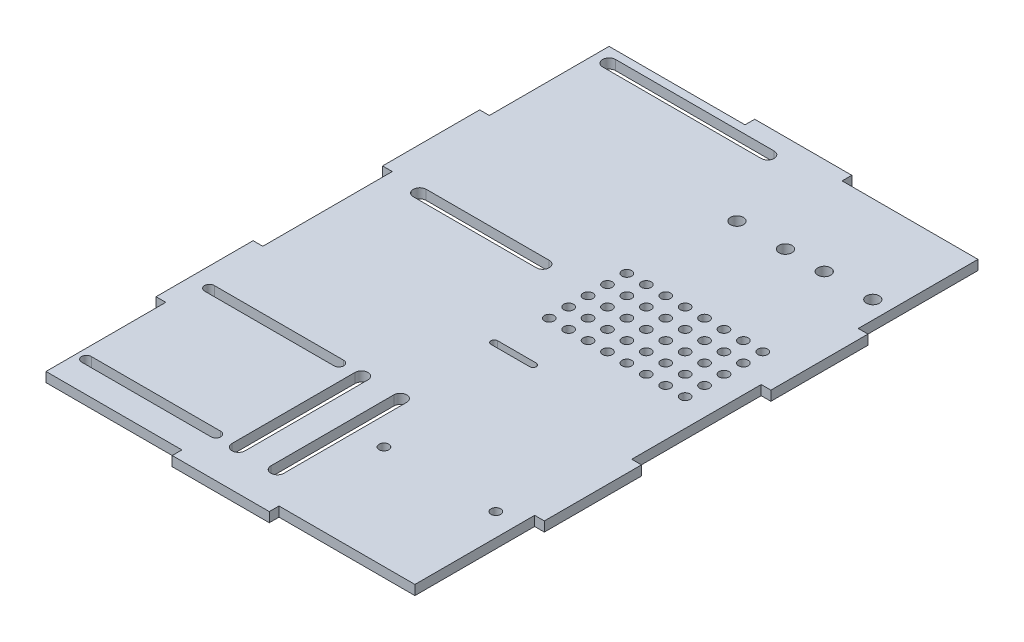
from build123d import *

# Parameters (mm, degrees)
SKETCH1_W           = 120
SKETCH1_H           = 180
BOSS_EXTRUDE1_DEPTH = 3
SKETCH2_R           = 1.5
SKETCH2_R_2         = 1
SKETCH2_R_3         = 2
CUT_EXTRUDE1_DEPTH  = 109.208132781
SKETCH3_W           = 3
SKETCH3_H           = 40
CUT_EXTRUDE2_DEPTH  = 10
SKETCH4_W           = 42
SKETCH4_H           = 3
CUT_EXTRUDE3_DEPTH  = 10
CUT_EXTRUDE4_DEPTH  = 3
CUT_EXTRUDE5_DEPTH  = 3
CUT_EXTRUDE6_DEPTH  = 10
SKETCH9_R           = 1.5
CUT_EXTRUDE7_DEPTH  = 10


with BuildPart() as part:
    # Sketch1 → Boss-Extrude1 (new body)
    with BuildSketch(Plane(origin=(0, 0, 0), x_dir=(1, 0, 0), z_dir=(0, 1, 0))):
        Rectangle(SKETCH1_W, SKETCH1_H)
    extrude(amount=BOSS_EXTRUDE1_DEPTH)

    # Sketch2 → Cut-Extrude1 (cut, through all)
    with BuildSketch(Plane(origin=(0, 3, 0), x_dir=(1, 0, 0), z_dir=(0, 1, 0))):
        with Locations(Location((-16, -39.5, 0), (0, 0, 270))):
            Circle(SKETCH2_R)
        with Locations(Location((-54, -77.5, 0), (0, 0, 270))):
            Circle(SKETCH2_R)
        with Locations(Location((-16, -77.5, 0), (0, 0, 270))):
            Circle(SKETCH2_R)
        with Locations(Location((-54, -39.5, 0), (0, 0, 270))):
            Circle(SKETCH2_R)
        with Locations(Location((5.5, -10, 0), (0, 0, 270))):
            Circle(SKETCH2_R_2)
        with Locations(Location((15.5, -10, 0), (0, 0, 270))):
            Circle(SKETCH2_R_2)
        with Locations(Location((15.424618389, -55, 0), (0, 0, 270))):
            Circle(SKETCH2_R)
        with Locations(Location((50, -55, 0), (0, 0, 270))):
            Circle(SKETCH2_R)
        with Locations(Location((9.5, 60, 0), (0, 0, 270))):
            Circle(SKETCH2_R_3)
        with Locations(Location((24.5, 60, 0), (0, 0, 270))):
            Circle(SKETCH2_R_3)
        with Locations(Location((36.5, 60, 0), (0, 0, 270))):
            Circle(SKETCH2_R_3)
        with Locations(Location((51.5, 60, 0), (0, 0, 270))):
            Circle(SKETCH2_R_3)
        with BuildLine():
            Line((-52.5, 80.5), (-3.5, 80.5))
            ThreePointArc((-3.5, 80.5), (-1.5, 82.5), (-3.5, 84.5))
            Line((-3.5, 84.5), (-52.5, 84.5))
            ThreePointArc((-52.5, 84.5), (-54.5, 82.5), (-52.5, 80.5))
        make_face()
        with BuildLine():
            Line((-9, 20.5), (-47, 20.5))
            ThreePointArc((-47, 20.5), (-49, 18.5), (-47, 16.5))
            Line((-47, 16.5), (-9, 16.5))
            ThreePointArc((-9, 16.5), (-7, 18.5), (-9, 20.5))
        make_face()
    extrude(amount=-CUT_EXTRUDE1_DEPTH, mode=Mode.SUBTRACT)

    # Sketch3 → Cut-Extrude2 (cut)
    with BuildSketch(Plane(origin=(0, 3, 0), x_dir=(1, 0, 0), z_dir=(0, 1, 0))):
        with Locations((-58.5, 70)):
            Rectangle(SKETCH3_W, SKETCH3_H)
        with Locations((-58.5, -70)):
            Rectangle(SKETCH3_W, SKETCH3_H)
        with Locations((-58.5, 0)):
            Rectangle(SKETCH3_W, SKETCH3_H)
    cut_extrude2 = extrude(amount=-CUT_EXTRUDE2_DEPTH, mode=Mode.SUBTRACT)

    # Mirror1: Cut-Extrude2 across plane
    add(cut_extrude2.mirror(Plane(origin=(0, 0, 0), x_dir=(0, 0, 1), z_dir=(1, 0, 0))), mode=Mode.SUBTRACT)

    # Sketch4 → Cut-Extrude3 (cut)
    with BuildSketch(Plane(origin=(0, 3, 0), x_dir=(1, 0, 0), z_dir=(0, 1, 0))):
        with Locations((-36, -88.5)):
            Rectangle(SKETCH4_W, SKETCH4_H)
        with Locations((36, -88.5)):
            Rectangle(SKETCH4_W, SKETCH4_H)
    cut_extrude3 = extrude(amount=-CUT_EXTRUDE3_DEPTH, mode=Mode.SUBTRACT)

    # Mirror2: Cut-Extrude3 across plane
    add(cut_extrude3.mirror(Plane.XY), mode=Mode.SUBTRACT)

    # Sketch5 → Cut-Extrude4 (cut)
    with BuildSketch(Plane(origin=(0, 3, 0), x_dir=(1, 0, 0), z_dir=(0, 1, 0))):
        with BuildLine():
            Line((-54, -38), (-14, -38))
            ThreePointArc((-14, -38), (-12.5, -39.5), (-14, -41))
            Line((-14, -41), (-54, -41))
            ThreePointArc((-54, -41), (-55.5, -39.5), (-54, -38))
        make_face()
        with BuildLine():
            Line((-54, -76), (-14, -76))
            ThreePointArc((-14, -76), (-12.5, -77.5), (-14, -79))
            Line((-14, -79), (-54, -79))
            ThreePointArc((-54, -79), (-55.5, -77.5), (-54, -76))
        make_face()
    extrude(amount=-CUT_EXTRUDE4_DEPTH, mode=Mode.SUBTRACT)

    # Sketch6 → Cut-Extrude5 (cut)
    with BuildSketch(Plane(origin=(0, 3, 0), x_dir=(1, 0, 0), z_dir=(0, 1, 0))):
        with BuildLine():
            Line((4.5, -9), (16.5, -9))
            ThreePointArc((16.5, -9), (17.5, -10), (16.5, -11))
            Line((16.5, -11), (4.5, -11))
            ThreePointArc((4.5, -11), (3.5, -10), (4.5, -9))
        make_face()
    extrude(amount=-CUT_EXTRUDE5_DEPTH, mode=Mode.SUBTRACT)

    # Sketch7 → Cut-Extrude6 (cut)
    with BuildSketch(Plane(origin=(0, 3, 0), x_dir=(1, 0, 0), z_dir=(0, 1, 0))):
        with BuildLine():
            Line((-5, -39.5), (-5, -77.5))
            ThreePointArc((-5, -77.5), (-7, -79.5), (-9, -77.5))
            Line((-9, -77.5), (-9, -39.5))
            ThreePointArc((-9, -39.5), (-7, -37.5), (-5, -39.5))
        make_face()
        with BuildLine():
            Line((7, -39.5), (7, -77.5))
            ThreePointArc((7, -77.5), (5, -79.5), (3, -77.5))
            Line((3, -77.5), (3, -39.5))
            ThreePointArc((3, -39.5), (5, -37.5), (7, -39.5))
        make_face()
    extrude(amount=-CUT_EXTRUDE6_DEPTH, mode=Mode.SUBTRACT)

    # Sketch9 → Cut-Extrude7 (cut)
    with BuildSketch(Plane(origin=(0, 3, 0), x_dir=(1, 0, 0), z_dir=(0, 1, 0))):
        with Locations(Location((6.5, 29, 0), (0, 0, 270))):
            Circle(SKETCH9_R)
        with Locations(Location((12.5, 29, 0), (0, 0, 270))):
            Circle(SKETCH9_R)
        with Locations(Location((18.5, 29, 0), (0, 0, 270))):
            Circle(SKETCH9_R)
        with Locations(Location((24.5, 29, 0), (0, 0, 270))):
            Circle(SKETCH9_R)
        with Locations(Location((30.5, 29, 0), (0, 0, 270))):
            Circle(SKETCH9_R)
        with Locations(Location((36.5, 29, 0), (0, 0, 270))):
            Circle(SKETCH9_R)
        with Locations(Location((42.5, 29, 0), (0, 0, 270))):
            Circle(SKETCH9_R)
        with Locations(Location((48.5, 29, 0), (0, 0, 270))):
            Circle(SKETCH9_R)
        with Locations(Location((12.5, 23, 0), (0, 0, 270))):
            Circle(SKETCH9_R)
        with Locations(Location((18.5, 23, 0), (0, 0, 270))):
            Circle(SKETCH9_R)
        with Locations(Location((24.5, 23, 0), (0, 0, 270))):
            Circle(SKETCH9_R)
        with Locations(Location((30.5, 23, 0), (0, 0, 270))):
            Circle(SKETCH9_R)
        with Locations(Location((36.5, 23, 0), (0, 0, 270))):
            Circle(SKETCH9_R)
        with Locations(Location((42.5, 23, 0), (0, 0, 270))):
            Circle(SKETCH9_R)
        with Locations(Location((48.5, 23, 0), (0, 0, 270))):
            Circle(SKETCH9_R)
        with Locations(Location((12.5, 17, 0), (0, 0, 270))):
            Circle(SKETCH9_R)
        with Locations(Location((18.5, 17, 0), (0, 0, 270))):
            Circle(SKETCH9_R)
        with Locations(Location((24.5, 17, 0), (0, 0, 270))):
            Circle(SKETCH9_R)
        with Locations(Location((30.5, 17, 0), (0, 0, 270))):
            Circle(SKETCH9_R)
        with Locations(Location((36.5, 17, 0), (0, 0, 270))):
            Circle(SKETCH9_R)
        with Locations(Location((42.5, 17, 0), (0, 0, 270))):
            Circle(SKETCH9_R)
        with Locations(Location((48.5, 17, 0), (0, 0, 270))):
            Circle(SKETCH9_R)
        with Locations(Location((12.5, 11, 0), (0, 0, 270))):
            Circle(SKETCH9_R)
        with Locations(Location((18.5, 11, 0), (0, 0, 270))):
            Circle(SKETCH9_R)
        with Locations(Location((24.5, 11, 0), (0, 0, 270))):
            Circle(SKETCH9_R)
        with Locations(Location((30.5, 11, 0), (0, 0, 270))):
            Circle(SKETCH9_R)
        with Locations(Location((36.5, 11, 0), (0, 0, 270))):
            Circle(SKETCH9_R)
        with Locations(Location((42.5, 11, 0), (0, 0, 270))):
            Circle(SKETCH9_R)
        with Locations(Location((48.5, 11, 0), (0, 0, 270))):
            Circle(SKETCH9_R)
        with Locations(Location((12.5, 5, 0), (0, 0, 270))):
            Circle(SKETCH9_R)
        with Locations(Location((18.5, 5, 0), (0, 0, 270))):
            Circle(SKETCH9_R)
        with Locations(Location((24.5, 5, 0), (0, 0, 270))):
            Circle(SKETCH9_R)
        with Locations(Location((30.5, 5, 0), (0, 0, 270))):
            Circle(SKETCH9_R)
        with Locations(Location((36.5, 5, 0), (0, 0, 270))):
            Circle(SKETCH9_R)
        with Locations(Location((42.5, 5, 0), (0, 0, 270))):
            Circle(SKETCH9_R)
        with Locations(Location((48.5, 5, 0), (0, 0, 270))):
            Circle(SKETCH9_R)
        with Locations(Location((6.5, 23, 0), (0, 0, 270))):
            Circle(SKETCH9_R)
        with Locations(Location((6.5, 17, 0), (0, 0, 270))):
            Circle(SKETCH9_R)
        with Locations(Location((6.5, 11, 0), (0, 0, 270))):
            Circle(SKETCH9_R)
        with Locations(Location((6.5, 5, 0), (0, 0, 270))):
            Circle(SKETCH9_R)
    extrude(amount=-CUT_EXTRUDE7_DEPTH, mode=Mode.SUBTRACT)


solid = part.part
